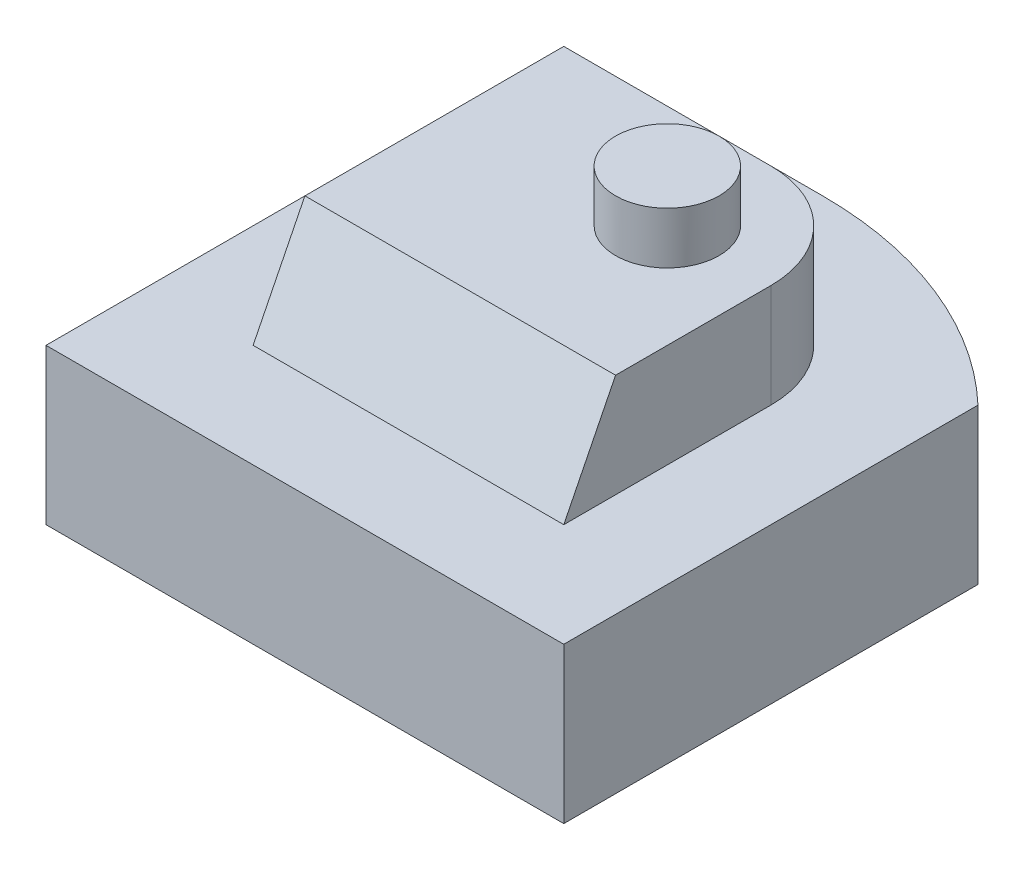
ISO-10303-21;
HEADER;
FILE_DESCRIPTION(('STEP AP214'),'2;1');
FILE_NAME('part.step','',(''),(''),'','','');
FILE_SCHEMA(('AUTOMOTIVE_DESIGN { 1 0 10303 214 1 1 1 1 }'));
ENDSEC;
DATA;
#1=APPLICATION_CONTEXT('core data for automotive mechanical design processes');
#2=APPLICATION_PROTOCOL_DEFINITION('international standard','automotive_design',2000,#1);
#3=PRODUCT_CONTEXT('',#1,'mechanical');
#4=PRODUCT('Part','Part','',(#3));
#5=PRODUCT_RELATED_PRODUCT_CATEGORY('part','',(#4));
#6=PRODUCT_DEFINITION_FORMATION('','',#4);
#7=PRODUCT_DEFINITION_CONTEXT('part definition',#1,'design');
#8=PRODUCT_DEFINITION('design','',#6,#7);
#9=PRODUCT_DEFINITION_SHAPE('','',#8);
#10=(LENGTH_UNIT() NAMED_UNIT(*) SI_UNIT(.MILLI.,.METRE.));
#11=(NAMED_UNIT(*) PLANE_ANGLE_UNIT() SI_UNIT($,.RADIAN.));
#12=(NAMED_UNIT(*) SI_UNIT($,.STERADIAN.) SOLID_ANGLE_UNIT());
#13=UNCERTAINTY_MEASURE_WITH_UNIT(LENGTH_MEASURE(1.E-05),#10,'distance_accuracy_value','');
#14=(GEOMETRIC_REPRESENTATION_CONTEXT(3) GLOBAL_UNCERTAINTY_ASSIGNED_CONTEXT((#13)) GLOBAL_UNIT_ASSIGNED_CONTEXT((#10,
#11,#12)) REPRESENTATION_CONTEXT('',''));
#15=CARTESIAN_POINT('',(0.,0.,0.));
#16=DIRECTION('',(0.,0.,1.));
#17=DIRECTION('',(1.,0.,0.));
#18=AXIS2_PLACEMENT_3D('',#15,#16,#17);
#19=CARTESIAN_POINT('',(-30.,50.,-30.));
#20=DIRECTION('',(0.,-1.,0.));
#21=DIRECTION('',(0.,0.,-1.));
#22=AXIS2_PLACEMENT_3D('',#19,#20,#21);
#23=PLANE('',#22);
#24=DIRECTION('',(0.,0.,-1.));
#25=VECTOR('',#24,1.);
#26=CARTESIAN_POINT('',(30.,50.,30.));
#27=LINE('',#26,#25);
#28=CARTESIAN_POINT('',(30.,50.,20.));
#29=VERTEX_POINT('',#28);
#30=CARTESIAN_POINT('',(30.,50.,-9.99999999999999));
#31=VERTEX_POINT('',#30);
#32=EDGE_CURVE('E164',#29,#31,#27,.T.);
#33=ORIENTED_EDGE('',*,*,#32,.T.);
#34=CARTESIAN_POINT('',(10.,50.,-10.));
#35=DIRECTION('',(0.,-1.,0.));
#36=DIRECTION('',(0.,0.,-1.));
#37=AXIS2_PLACEMENT_3D('',#34,#35,#36);
#38=CIRCLE('',#37,20.);
#39=CARTESIAN_POINT('',(10.,50.,-30.));
#40=VERTEX_POINT('',#39);
#41=EDGE_CURVE('E154',#31,#40,#38,.F.);
#42=ORIENTED_EDGE('',*,*,#41,.T.);
#43=DIRECTION('',(-1.,0.,0.));
#44=VECTOR('',#43,1.);
#45=CARTESIAN_POINT('',(-30.,50.,-30.));
#46=LINE('',#45,#44);
#47=CARTESIAN_POINT('',(-30.,50.,-30.));
#48=VERTEX_POINT('',#47);
#49=EDGE_CURVE('E161',#40,#48,#46,.T.);
#50=ORIENTED_EDGE('',*,*,#49,.T.);
#51=DIRECTION('',(0.,0.,1.));
#52=VECTOR('',#51,1.);
#53=CARTESIAN_POINT('',(-30.,50.,30.));
#54=LINE('',#53,#52);
#55=CARTESIAN_POINT('',(-30.,50.,20.));
#56=VERTEX_POINT('',#55);
#57=EDGE_CURVE('E183',#48,#56,#54,.T.);
#58=ORIENTED_EDGE('',*,*,#57,.T.);
#59=DIRECTION('',(1.,0.,0.));
#60=VECTOR('',#59,1.);
#61=CARTESIAN_POINT('',(-30.,50.,20.));
#62=LINE('',#61,#60);
#63=EDGE_CURVE('E146',#56,#29,#62,.T.);
#64=ORIENTED_EDGE('',*,*,#63,.T.);
#65=EDGE_LOOP('',(#33,#42,#50,#58,#64));
#66=FACE_BOUND('',#65,.T.);
#67=CARTESIAN_POINT('',(10.,50.,-10.));
#68=DIRECTION('',(0.,-1.,0.));
#69=DIRECTION('',(0.,0.,-1.));
#70=AXIS2_PLACEMENT_3D('',#67,#68,#69);
#71=CIRCLE('',#70,10.);
#72=CARTESIAN_POINT('',(10.,50.,-20.));
#73=VERTEX_POINT('',#72);
#74=EDGE_CURVE('E11',#73,#73,#71,.F.);
#75=ORIENTED_EDGE('',*,*,#74,.F.);
#76=EDGE_LOOP('',(#75));
#77=FACE_BOUND('',#76,.T.);
#78=ADVANCED_FACE('F31',(#66,#77),#23,.F.);
#79=CARTESIAN_POINT('',(-50.,30.,-50.));
#80=DIRECTION('',(0.,-1.,0.));
#81=DIRECTION('',(0.,0.,-1.));
#82=AXIS2_PLACEMENT_3D('',#79,#80,#81);
#83=PLANE('',#82);
#84=DIRECTION('',(0.,0.,-1.));
#85=VECTOR('',#84,1.);
#86=CARTESIAN_POINT('',(50.,30.,50.));
#87=LINE('',#86,#85);
#88=CARTESIAN_POINT('',(50.,30.,50.));
#89=VERTEX_POINT('',#88);
#90=CARTESIAN_POINT('',(50.,30.,-30.));
#91=VERTEX_POINT('',#90);
#92=EDGE_CURVE('E191',#89,#91,#87,.T.);
#93=ORIENTED_EDGE('',*,*,#92,.T.);
#94=CARTESIAN_POINT('',(0.,30.,22.5));
#95=DIRECTION('',(0.,-1.,0.));
#96=DIRECTION('',(0.,0.,-1.));
#97=AXIS2_PLACEMENT_3D('',#94,#95,#96);
#98=CIRCLE('',#97,72.5);
#99=CARTESIAN_POINT('',(0.,30.,-50.));
#100=VERTEX_POINT('',#99);
#101=EDGE_CURVE('E114',#100,#91,#98,.T.);
#102=ORIENTED_EDGE('',*,*,#101,.F.);
#103=DIRECTION('',(-1.,0.,0.));
#104=VECTOR('',#103,1.);
#105=CARTESIAN_POINT('',(-50.,30.,-50.));
#106=LINE('',#105,#104);
#107=CARTESIAN_POINT('',(-50.,30.,-50.));
#108=VERTEX_POINT('',#107);
#109=EDGE_CURVE('E122',#100,#108,#106,.T.);
#110=ORIENTED_EDGE('',*,*,#109,.T.);
#111=DIRECTION('',(0.,0.,1.));
#112=VECTOR('',#111,1.);
#113=CARTESIAN_POINT('',(-50.,30.,50.));
#114=LINE('',#113,#112);
#115=CARTESIAN_POINT('',(-50.,30.,50.));
#116=VERTEX_POINT('',#115);
#117=EDGE_CURVE('E129',#108,#116,#114,.T.);
#118=ORIENTED_EDGE('',*,*,#117,.T.);
#119=DIRECTION('',(1.,0.,0.));
#120=VECTOR('',#119,1.);
#121=CARTESIAN_POINT('',(-50.,30.,50.));
#122=LINE('',#121,#120);
#123=EDGE_CURVE('E132',#116,#89,#122,.T.);
#124=ORIENTED_EDGE('',*,*,#123,.T.);
#125=EDGE_LOOP('',(#93,#102,#110,#118,#124));
#126=FACE_BOUND('',#125,.T.);
#127=DIRECTION('',(0.,0.,1.));
#128=VECTOR('',#127,1.);
#129=CARTESIAN_POINT('',(-30.,30.,30.));
#130=LINE('',#129,#128);
#131=CARTESIAN_POINT('',(-30.,30.,-30.));
#132=VERTEX_POINT('',#131);
#133=CARTESIAN_POINT('',(-30.,30.,30.));
#134=VERTEX_POINT('',#133);
#135=EDGE_CURVE('E185',#132,#134,#130,.T.);
#136=ORIENTED_EDGE('',*,*,#135,.F.);
#137=DIRECTION('',(-1.,0.,0.));
#138=VECTOR('',#137,1.);
#139=CARTESIAN_POINT('',(-30.,30.,-30.));
#140=LINE('',#139,#138);
#141=CARTESIAN_POINT('',(10.,30.,-30.));
#142=VERTEX_POINT('',#141);
#143=EDGE_CURVE('E180',#142,#132,#140,.T.);
#144=ORIENTED_EDGE('',*,*,#143,.F.);
#145=CARTESIAN_POINT('',(10.,30.,-10.));
#146=DIRECTION('',(0.,-1.,0.));
#147=DIRECTION('',(0.,0.,-1.));
#148=AXIS2_PLACEMENT_3D('',#145,#146,#147);
#149=CIRCLE('',#148,20.);
#150=CARTESIAN_POINT('',(30.,30.,-9.99999999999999));
#151=VERTEX_POINT('',#150);
#152=EDGE_CURVE('E39',#142,#151,#149,.T.);
#153=ORIENTED_EDGE('',*,*,#152,.T.);
#154=DIRECTION('',(0.,0.,-1.));
#155=VECTOR('',#154,1.);
#156=CARTESIAN_POINT('',(30.,30.,30.));
#157=LINE('',#156,#155);
#158=CARTESIAN_POINT('',(30.,30.,30.));
#159=VERTEX_POINT('',#158);
#160=EDGE_CURVE('E177',#159,#151,#157,.T.);
#161=ORIENTED_EDGE('',*,*,#160,.F.);
#162=DIRECTION('',(1.,0.,0.));
#163=VECTOR('',#162,1.);
#164=CARTESIAN_POINT('',(-30.,30.,30.));
#165=LINE('',#164,#163);
#166=EDGE_CURVE('E181',#134,#159,#165,.T.);
#167=ORIENTED_EDGE('',*,*,#166,.F.);
#168=EDGE_LOOP('',(#136,#144,#153,#161,#167));
#169=FACE_BOUND('',#168,.T.);
#170=ADVANCED_FACE('F204',(#126,#169),#83,.F.);
#171=CARTESIAN_POINT('',(-50.,30.,50.));
#172=DIRECTION('',(1.,0.,0.));
#173=DIRECTION('',(0.,0.,-1.));
#174=AXIS2_PLACEMENT_3D('',#171,#172,#173);
#175=PLANE('',#174);
#176=DIRECTION('',(0.,0.,1.));
#177=VECTOR('',#176,1.);
#178=CARTESIAN_POINT('',(-50.,0.,50.));
#179=LINE('',#178,#177);
#180=CARTESIAN_POINT('',(-50.,0.,-50.));
#181=VERTEX_POINT('',#180);
#182=CARTESIAN_POINT('',(-50.,0.,50.));
#183=VERTEX_POINT('',#182);
#184=EDGE_CURVE('E128',#181,#183,#179,.T.);
#185=ORIENTED_EDGE('',*,*,#184,.T.);
#186=DIRECTION('',(0.,-1.,0.));
#187=VECTOR('',#186,1.);
#188=CARTESIAN_POINT('',(-50.,30.,50.));
#189=LINE('',#188,#187);
#190=EDGE_CURVE('E143',#116,#183,#189,.T.);
#191=ORIENTED_EDGE('',*,*,#190,.F.);
#192=ORIENTED_EDGE('',*,*,#117,.F.);
#193=DIRECTION('',(0.,-1.,0.));
#194=VECTOR('',#193,1.);
#195=CARTESIAN_POINT('',(-50.,30.,-50.));
#196=LINE('',#195,#194);
#197=EDGE_CURVE('E138',#108,#181,#196,.T.);
#198=ORIENTED_EDGE('',*,*,#197,.T.);
#199=EDGE_LOOP('',(#185,#191,#192,#198));
#200=FACE_BOUND('',#199,.T.);
#201=ADVANCED_FACE('F207',(#200),#175,.F.);
#202=CARTESIAN_POINT('',(-50.,30.,50.));
#203=DIRECTION('',(0.,0.,-1.));
#204=DIRECTION('',(-1.,0.,0.));
#205=AXIS2_PLACEMENT_3D('',#202,#203,#204);
#206=PLANE('',#205);
#207=DIRECTION('',(1.,0.,0.));
#208=VECTOR('',#207,1.);
#209=CARTESIAN_POINT('',(-50.,0.,50.));
#210=LINE('',#209,#208);
#211=CARTESIAN_POINT('',(50.,0.,50.));
#212=VERTEX_POINT('',#211);
#213=EDGE_CURVE('E134',#183,#212,#210,.T.);
#214=ORIENTED_EDGE('',*,*,#213,.T.);
#215=DIRECTION('',(0.,-1.,0.));
#216=VECTOR('',#215,1.);
#217=CARTESIAN_POINT('',(50.,30.,50.));
#218=LINE('',#217,#216);
#219=EDGE_CURVE('E140',#89,#212,#218,.T.);
#220=ORIENTED_EDGE('',*,*,#219,.F.);
#221=ORIENTED_EDGE('',*,*,#123,.F.);
#222=ORIENTED_EDGE('',*,*,#190,.T.);
#223=EDGE_LOOP('',(#214,#220,#221,#222));
#224=FACE_BOUND('',#223,.T.);
#225=ADVANCED_FACE('F197',(#224),#206,.F.);
#226=CARTESIAN_POINT('',(50.,30.,50.));
#227=DIRECTION('',(-1.,0.,0.));
#228=DIRECTION('',(0.,0.,1.));
#229=AXIS2_PLACEMENT_3D('',#226,#227,#228);
#230=PLANE('',#229);
#231=DIRECTION('',(0.,0.,-1.));
#232=VECTOR('',#231,1.);
#233=CARTESIAN_POINT('',(50.,0.,50.));
#234=LINE('',#233,#232);
#235=CARTESIAN_POINT('',(50.,0.,-30.));
#236=VERTEX_POINT('',#235);
#237=EDGE_CURVE('E130',#212,#236,#234,.T.);
#238=ORIENTED_EDGE('',*,*,#237,.T.);
#239=DIRECTION('',(0.,1.,0.));
#240=VECTOR('',#239,1.);
#241=CARTESIAN_POINT('',(50.,0.,-30.));
#242=LINE('',#241,#240);
#243=EDGE_CURVE('E46',#236,#91,#242,.T.);
#244=ORIENTED_EDGE('',*,*,#243,.T.);
#245=ORIENTED_EDGE('',*,*,#92,.F.);
#246=ORIENTED_EDGE('',*,*,#219,.T.);
#247=EDGE_LOOP('',(#238,#244,#245,#246));
#248=FACE_BOUND('',#247,.T.);
#249=ADVANCED_FACE('F202',(#248),#230,.F.);
#250=CARTESIAN_POINT('',(-50.,30.,-50.));
#251=DIRECTION('',(0.,0.,1.));
#252=DIRECTION('',(1.,0.,0.));
#253=AXIS2_PLACEMENT_3D('',#250,#251,#252);
#254=PLANE('',#253);
#255=ORIENTED_EDGE('',*,*,#109,.F.);
#256=DIRECTION('',(0.,1.,0.));
#257=VECTOR('',#256,1.);
#258=CARTESIAN_POINT('',(0.,0.,-50.));
#259=LINE('',#258,#257);
#260=CARTESIAN_POINT('',(0.,0.,-50.));
#261=VERTEX_POINT('',#260);
#262=EDGE_CURVE('E108',#261,#100,#259,.T.);
#263=ORIENTED_EDGE('',*,*,#262,.F.);
#264=DIRECTION('',(-1.,0.,0.));
#265=VECTOR('',#264,1.);
#266=CARTESIAN_POINT('',(-50.,0.,-50.));
#267=LINE('',#266,#265);
#268=EDGE_CURVE('E120',#261,#181,#267,.T.);
#269=ORIENTED_EDGE('',*,*,#268,.T.);
#270=ORIENTED_EDGE('',*,*,#197,.F.);
#271=EDGE_LOOP('',(#255,#263,#269,#270));
#272=FACE_BOUND('',#271,.T.);
#273=ADVANCED_FACE('F118',(#272),#254,.F.);
#274=CARTESIAN_POINT('',(-50.,0.,-50.));
#275=DIRECTION('',(0.,-1.,0.));
#276=DIRECTION('',(0.,0.,-1.));
#277=AXIS2_PLACEMENT_3D('',#274,#275,#276);
#278=PLANE('',#277);
#279=CARTESIAN_POINT('',(0.,0.,22.5));
#280=DIRECTION('',(0.,-1.,0.));
#281=DIRECTION('',(0.,0.,-1.));
#282=AXIS2_PLACEMENT_3D('',#279,#280,#281);
#283=CIRCLE('',#282,72.5);
#284=EDGE_CURVE('E105',#261,#236,#283,.T.);
#285=ORIENTED_EDGE('',*,*,#284,.T.);
#286=ORIENTED_EDGE('',*,*,#237,.F.);
#287=ORIENTED_EDGE('',*,*,#213,.F.);
#288=ORIENTED_EDGE('',*,*,#184,.F.);
#289=ORIENTED_EDGE('',*,*,#268,.F.);
#290=EDGE_LOOP('',(#285,#286,#287,#288,#289));
#291=FACE_BOUND('',#290,.T.);
#292=ADVANCED_FACE('F126',(#291),#278,.T.);
#293=CARTESIAN_POINT('',(-30.,50.,30.));
#294=DIRECTION('',(1.,0.,0.));
#295=DIRECTION('',(0.,0.,-1.));
#296=AXIS2_PLACEMENT_3D('',#293,#294,#295);
#297=PLANE('',#296);
#298=ORIENTED_EDGE('',*,*,#135,.T.);
#299=DIRECTION('',(0.,0.894427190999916,-0.447213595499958));
#300=VECTOR('',#299,1.);
#301=CARTESIAN_POINT('',(-30.,46.,22.));
#302=LINE('',#301,#300);
#303=EDGE_CURVE('E337',#134,#56,#302,.T.);
#304=ORIENTED_EDGE('',*,*,#303,.T.);
#305=ORIENTED_EDGE('',*,*,#57,.F.);
#306=DIRECTION('',(0.,-1.,0.));
#307=VECTOR('',#306,1.);
#308=CARTESIAN_POINT('',(-30.,50.,-30.));
#309=LINE('',#308,#307);
#310=EDGE_CURVE('E171',#48,#132,#309,.T.);
#311=ORIENTED_EDGE('',*,*,#310,.T.);
#312=EDGE_LOOP('',(#298,#304,#305,#311));
#313=FACE_BOUND('',#312,.T.);
#314=ADVANCED_FACE('F227',(#313),#297,.F.);
#315=CARTESIAN_POINT('',(30.,50.,30.));
#316=DIRECTION('',(-1.,0.,0.));
#317=DIRECTION('',(0.,0.,1.));
#318=AXIS2_PLACEMENT_3D('',#315,#316,#317);
#319=PLANE('',#318);
#320=ORIENTED_EDGE('',*,*,#160,.T.);
#321=DIRECTION('',(0.,-1.,0.));
#322=VECTOR('',#321,1.);
#323=CARTESIAN_POINT('',(30.,50.,-9.99999999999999));
#324=LINE('',#323,#322);
#325=EDGE_CURVE('E152',#151,#31,#324,.F.);
#326=ORIENTED_EDGE('',*,*,#325,.T.);
#327=ORIENTED_EDGE('',*,*,#32,.F.);
#328=DIRECTION('',(0.,0.894427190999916,-0.447213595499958));
#329=VECTOR('',#328,1.);
#330=CARTESIAN_POINT('',(30.,50.,20.));
#331=LINE('',#330,#329);
#332=EDGE_CURVE('E178',#159,#29,#331,.T.);
#333=ORIENTED_EDGE('',*,*,#332,.F.);
#334=EDGE_LOOP('',(#320,#326,#327,#333));
#335=FACE_BOUND('',#334,.T.);
#336=ADVANCED_FACE('F175',(#335),#319,.F.);
#337=CARTESIAN_POINT('',(-30.,50.,-30.));
#338=DIRECTION('',(0.,0.,1.));
#339=DIRECTION('',(1.,0.,0.));
#340=AXIS2_PLACEMENT_3D('',#337,#338,#339);
#341=PLANE('',#340);
#342=ORIENTED_EDGE('',*,*,#49,.F.);
#343=DIRECTION('',(0.,-1.,0.));
#344=VECTOR('',#343,1.);
#345=CARTESIAN_POINT('',(10.,50.,-30.));
#346=LINE('',#345,#344);
#347=EDGE_CURVE('E149',#40,#142,#346,.T.);
#348=ORIENTED_EDGE('',*,*,#347,.T.);
#349=ORIENTED_EDGE('',*,*,#143,.T.);
#350=ORIENTED_EDGE('',*,*,#310,.F.);
#351=EDGE_LOOP('',(#342,#348,#349,#350));
#352=FACE_BOUND('',#351,.T.);
#353=ADVANCED_FACE('F169',(#352),#341,.F.);
#354=CARTESIAN_POINT('',(-50.,50.,20.));
#355=DIRECTION('',(0.,-0.447213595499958,-0.894427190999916));
#356=DIRECTION('',(0.,0.894427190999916,-0.447213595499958));
#357=AXIS2_PLACEMENT_3D('',#354,#355,#356);
#358=PLANE('',#357);
#359=ORIENTED_EDGE('',*,*,#166,.T.);
#360=ORIENTED_EDGE('',*,*,#332,.T.);
#361=ORIENTED_EDGE('',*,*,#63,.F.);
#362=ORIENTED_EDGE('',*,*,#303,.F.);
#363=EDGE_LOOP('',(#359,#360,#361,#362));
#364=FACE_BOUND('',#363,.T.);
#365=ADVANCED_FACE('F221',(#364),#358,.F.);
#366=CARTESIAN_POINT('',(10.,50.,-10.));
#367=DIRECTION('',(0.,-1.,0.));
#368=DIRECTION('',(0.,0.,-1.));
#369=AXIS2_PLACEMENT_3D('',#366,#367,#368);
#370=CYLINDRICAL_SURFACE('',#369,20.);
#371=ORIENTED_EDGE('',*,*,#41,.F.);
#372=ORIENTED_EDGE('',*,*,#325,.F.);
#373=ORIENTED_EDGE('',*,*,#152,.F.);
#374=ORIENTED_EDGE('',*,*,#347,.F.);
#375=EDGE_LOOP('',(#371,#372,#373,#374));
#376=FACE_BOUND('',#375,.T.);
#377=ADVANCED_FACE('F33',(#376),#370,.T.);
#378=CARTESIAN_POINT('',(10.,60.,-10.));
#379=DIRECTION('',(0.,-1.,0.));
#380=DIRECTION('',(0.,0.,-1.));
#381=AXIS2_PLACEMENT_3D('',#378,#379,#380);
#382=CYLINDRICAL_SURFACE('',#381,10.);
#383=CARTESIAN_POINT('',(10.,60.,-10.));
#384=DIRECTION('',(0.,1.,0.));
#385=DIRECTION('',(0.,0.,1.));
#386=AXIS2_PLACEMENT_3D('',#383,#384,#385);
#387=CIRCLE('',#386,10.);
#388=CARTESIAN_POINT('',(10.,60.,0.));
#389=VERTEX_POINT('',#388);
#390=EDGE_CURVE('E123',#389,#389,#387,.T.);
#391=ORIENTED_EDGE('',*,*,#390,.F.);
#392=EDGE_LOOP('',(#391));
#393=FACE_BOUND('',#392,.T.);
#394=ORIENTED_EDGE('',*,*,#74,.T.);
#395=EDGE_LOOP('',(#394));
#396=FACE_BOUND('',#395,.T.);
#397=ADVANCED_FACE('F274',(#393,#396),#382,.T.);
#398=CARTESIAN_POINT('',(10.,60.,-10.));
#399=DIRECTION('',(0.,1.,0.));
#400=DIRECTION('',(0.,0.,1.));
#401=AXIS2_PLACEMENT_3D('',#398,#399,#400);
#402=PLANE('',#401);
#403=ORIENTED_EDGE('',*,*,#390,.T.);
#404=EDGE_LOOP('',(#403));
#405=FACE_BOUND('',#404,.T.);
#406=ADVANCED_FACE('F280',(#405),#402,.T.);
#407=CARTESIAN_POINT('',(0.,0.,22.5));
#408=DIRECTION('',(0.,1.,0.));
#409=DIRECTION('',(0.,0.,1.));
#410=AXIS2_PLACEMENT_3D('',#407,#408,#409);
#411=CYLINDRICAL_SURFACE('',#410,72.5);
#412=ORIENTED_EDGE('',*,*,#101,.T.);
#413=ORIENTED_EDGE('',*,*,#243,.F.);
#414=ORIENTED_EDGE('',*,*,#284,.F.);
#415=ORIENTED_EDGE('',*,*,#262,.T.);
#416=EDGE_LOOP('',(#412,#413,#414,#415));
#417=FACE_BOUND('',#416,.T.);
#418=ADVANCED_FACE('F107',(#417),#411,.T.);
#419=CLOSED_SHELL('',(#78,#170,#201,#225,#249,#273,#292,#314,#336,#353,#365,#377,#397,#406,#418));
#420=MANIFOLD_SOLID_BREP('B2',#419);
#421=ADVANCED_BREP_SHAPE_REPRESENTATION('',(#18,#420),#14);
#422=SHAPE_DEFINITION_REPRESENTATION(#9,#421);
ENDSEC;
END-ISO-10303-21;
